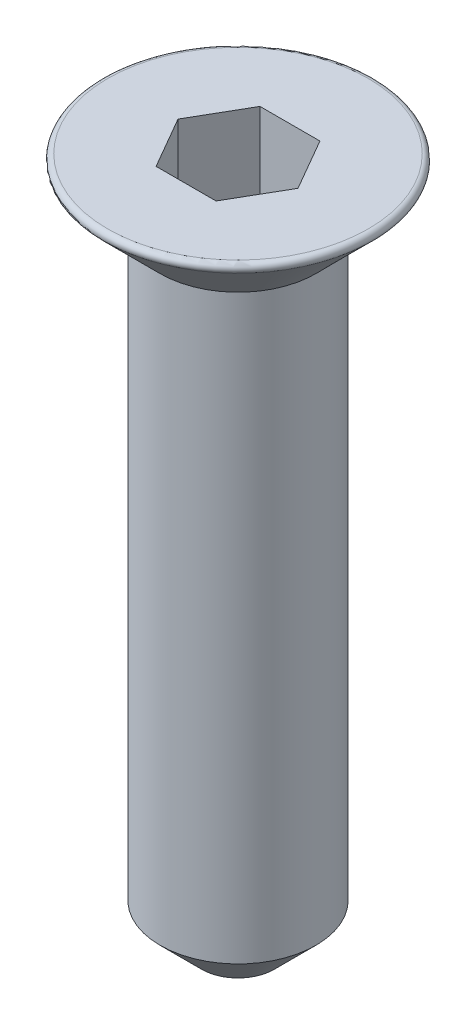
from build123d import *

# Parameters (mm, degrees)
CONG_1_R                = 0.1
CHANFREIN1_SIZE         = 0.8
ENL_V_MAT_EXTRU_1_DEPTH = 3


with BuildPart() as part:
    # Esquisse1 → R_volution1 (revolve)
    with BuildSketch(Plane.XY, mode=Mode.PRIVATE) as r_volution1_sk:
        Polygon((0, 0), (-2.75, 0), (-1.5, -1.25), (-1.5, -13.25), (0, -13.25), align=None)
    revolve(r_volution1_sk.sketch.rotate(Axis((0, 15.487971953, 0), (0, -1, 0)), 270), axis=Axis((0, 15.487971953, 0), (0, -1, 0)))

    # Cong_1
    cong_1_edges = [part.edges().sort_by_distance(p)[0] for p in [
        (0, 0, -2.75),
    ]]
    fillet(cong_1_edges, radius=CONG_1_R)

    # Chanfrein1
    chanfrein1_edges = [part.edges().sort_by_distance(p)[0] for p in [
        (0, -13.25, -1.5),
    ]]
    chamfer(chanfrein1_edges, length=CHANFREIN1_SIZE)

    # Esquisse2 → Enl_v. mat.-Extru.1 (cut)
    with BuildSketch(Plane(origin=(0, 0, 0), x_dir=(1, 0, 0), z_dir=(0, 1, 0))):
        Polygon((1.154700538, 0), (0.577350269, 1), (-0.577350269, 1), (-1.154700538, 0), (-0.577350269, -1), (0.577350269, -1), align=None)
    extrude(amount=-ENL_V_MAT_EXTRU_1_DEPTH, mode=Mode.SUBTRACT)


solid = part.part
